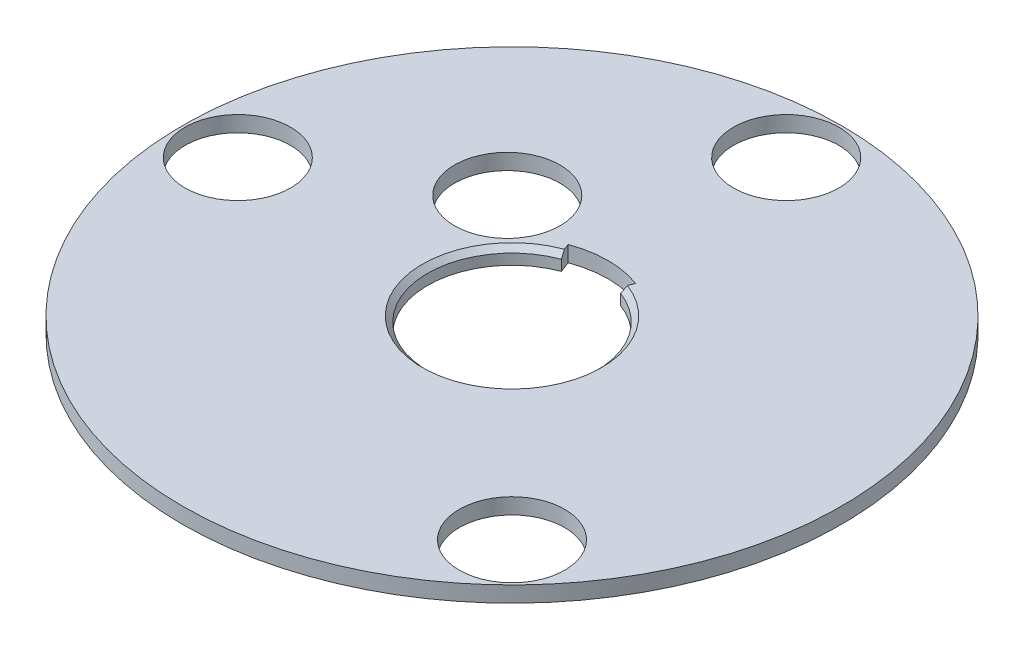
from build123d import *

# Parameters (mm, degrees)
SKETCH1_R           = 31.25
BOSS_EXTRUDE1_DEPTH = 1.5
CHAMFER1_SIZE       = 0.5
SKETCH2_R           = 5
CUT_EXTRUDE1_DEPTH  = 45.219622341


with BuildPart() as part:
    # Sketch1 → Boss-Extrude1 (new body)
    with BuildSketch(Plane(origin=(0, 0, 0), x_dir=(1, 0, 0), z_dir=(0, 1, 0))):
        with Locations(Location((0, 0, 0), (0, 0, 270))):
            Circle(SKETCH1_R)
        with BuildLine():
            Line((2.808987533, 7.490633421), (3, 8))
            Line((3, 8), (3.195223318, 8.520595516))
            ThreePointArc((3.195223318, 8.520595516), (0, 9.1), (-3.195223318, 8.520595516))
            Line((-3.195223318, 8.520595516), (-3, 8))
            Line((-3, 8), (-2.808987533, 7.490633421))
            ThreePointArc((-2.808987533, 7.490633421), (0, -8), (2.808987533, 7.490633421))
        make_face(mode=Mode.SUBTRACT)
    extrude(amount=-BOSS_EXTRUDE1_DEPTH)

    # Chamfer1
    chamfer1_edges = [part.edges().sort_by_distance(p)[0] for p in [
        (0, 0, 8),
    ]]
    chamfer(chamfer1_edges, length=CHAMFER1_SIZE)

    # Sketch2 → Cut-Extrude1 (cut, through all)
    with BuildSketch(Plane(origin=(0, 0, 0), x_dir=(1, 0, 0), z_dir=(0, 1, 0))):
        with Locations(Location((0, 26, 0), (0, 0, 270))):
            Circle(SKETCH2_R)
        with Locations(Location((18.384776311, -18.384776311, 0), (0, 0, 270))):
            Circle(SKETCH2_R)
        with Locations(Location((-26, 0, 0), (0, 0, 270))):
            Circle(SKETCH2_R)
        with Locations(Location((-10.121416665, 9.672482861, 0), (0, 0, 270))):
            Circle(SKETCH2_R)
    extrude(amount=-CUT_EXTRUDE1_DEPTH, mode=Mode.SUBTRACT)


solid = part.part
